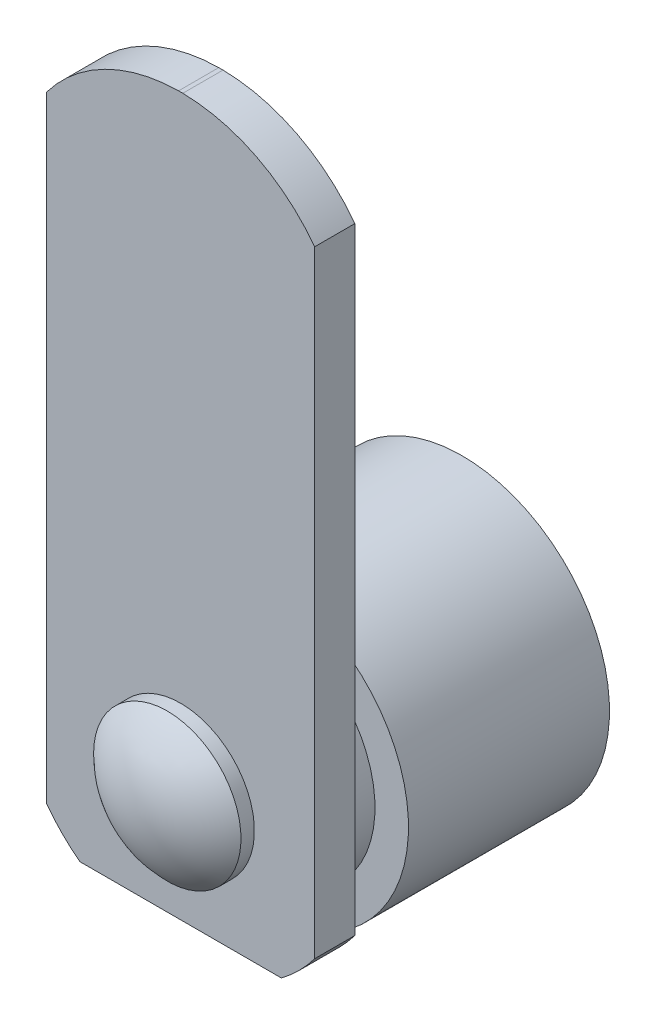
ISO-10303-21;
HEADER;
FILE_DESCRIPTION(('STEP AP214'),'2;1');
FILE_NAME('part.step','',(''),(''),'','','');
FILE_SCHEMA(('AUTOMOTIVE_DESIGN { 1 0 10303 214 1 1 1 1 }'));
ENDSEC;
DATA;
#1=APPLICATION_CONTEXT('core data for automotive mechanical design processes');
#2=APPLICATION_PROTOCOL_DEFINITION('international standard','automotive_design',2000,#1);
#3=PRODUCT_CONTEXT('',#1,'mechanical');
#4=PRODUCT('Part','Part','',(#3));
#5=PRODUCT_RELATED_PRODUCT_CATEGORY('part','',(#4));
#6=PRODUCT_DEFINITION_FORMATION('','',#4);
#7=PRODUCT_DEFINITION_CONTEXT('part definition',#1,'design');
#8=PRODUCT_DEFINITION('design','',#6,#7);
#9=PRODUCT_DEFINITION_SHAPE('','',#8);
#10=(LENGTH_UNIT() NAMED_UNIT(*) SI_UNIT(.MILLI.,.METRE.));
#11=(NAMED_UNIT(*) PLANE_ANGLE_UNIT() SI_UNIT($,.RADIAN.));
#12=(NAMED_UNIT(*) SI_UNIT($,.STERADIAN.) SOLID_ANGLE_UNIT());
#13=UNCERTAINTY_MEASURE_WITH_UNIT(LENGTH_MEASURE(1.E-05),#10,'distance_accuracy_value','');
#14=(GEOMETRIC_REPRESENTATION_CONTEXT(3) GLOBAL_UNCERTAINTY_ASSIGNED_CONTEXT((#13)) GLOBAL_UNIT_ASSIGNED_CONTEXT((#10,
#11,#12)) REPRESENTATION_CONTEXT('',''));
#15=CARTESIAN_POINT('',(0.,0.,0.));
#16=DIRECTION('',(0.,0.,1.));
#17=DIRECTION('',(1.,0.,0.));
#18=AXIS2_PLACEMENT_3D('',#15,#16,#17);
#19=CARTESIAN_POINT('',(0.,0.,-6.));
#20=DIRECTION('',(0.,0.,-1.));
#21=DIRECTION('',(-1.,0.,0.));
#22=AXIS2_PLACEMENT_3D('',#19,#20,#21);
#23=CYLINDRICAL_SURFACE('',#22,11.);
#24=CARTESIAN_POINT('',(0.,0.,15.));
#25=DIRECTION('',(0.,0.,-1.));
#26=DIRECTION('',(-1.,0.,0.));
#27=AXIS2_PLACEMENT_3D('',#24,#25,#26);
#28=CIRCLE('',#27,11.);
#29=CARTESIAN_POINT('',(-11.,0.,15.));
#30=VERTEX_POINT('',#29);
#31=EDGE_CURVE('E127',#30,#30,#28,.T.);
#32=ORIENTED_EDGE('',*,*,#31,.T.);
#33=EDGE_LOOP('',(#32));
#34=FACE_BOUND('',#33,.T.);
#35=CARTESIAN_POINT('',(0.,0.,0.));
#36=DIRECTION('',(0.,0.,-1.));
#37=DIRECTION('',(-1.,0.,0.));
#38=AXIS2_PLACEMENT_3D('',#35,#36,#37);
#39=CIRCLE('',#38,11.);
#40=CARTESIAN_POINT('',(-11.,0.,0.));
#41=VERTEX_POINT('',#40);
#42=EDGE_CURVE('E218',#41,#41,#39,.T.);
#43=ORIENTED_EDGE('',*,*,#42,.F.);
#44=EDGE_LOOP('',(#43));
#45=FACE_BOUND('',#44,.T.);
#46=ADVANCED_FACE('F14',(#34,#45),#23,.T.);
#47=CARTESIAN_POINT('',(0.,0.,18.));
#48=DIRECTION('',(0.,0.,-1.));
#49=DIRECTION('',(-1.,0.,0.));
#50=AXIS2_PLACEMENT_3D('',#47,#48,#49);
#51=CONICAL_SURFACE('',#50,7.79,0.785398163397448);
#52=CARTESIAN_POINT('',(0.,0.,17.29));
#53=DIRECTION('',(0.,0.,-1.));
#54=DIRECTION('',(-1.,0.,0.));
#55=AXIS2_PLACEMENT_3D('',#52,#53,#54);
#56=CIRCLE('',#55,8.5);
#57=CARTESIAN_POINT('',(-8.5,0.,17.29));
#58=VERTEX_POINT('',#57);
#59=EDGE_CURVE('E133',#58,#58,#56,.T.);
#60=ORIENTED_EDGE('',*,*,#59,.F.);
#61=EDGE_LOOP('',(#60));
#62=FACE_BOUND('',#61,.T.);
#63=CARTESIAN_POINT('',(0.,0.,18.));
#64=DIRECTION('',(0.,0.,1.));
#65=DIRECTION('',(1.,0.,0.));
#66=AXIS2_PLACEMENT_3D('',#63,#64,#65);
#67=CIRCLE('',#66,7.79);
#68=CARTESIAN_POINT('',(7.79,0.,18.));
#69=VERTEX_POINT('',#68);
#70=EDGE_CURVE('E124',#69,#69,#67,.T.);
#71=ORIENTED_EDGE('',*,*,#70,.F.);
#72=EDGE_LOOP('',(#71));
#73=FACE_BOUND('',#72,.T.);
#74=ADVANCED_FACE('F157',(#62,#73),#51,.T.);
#75=CARTESIAN_POINT('',(0.,0.,-6.));
#76=DIRECTION('',(0.,0.,-1.));
#77=DIRECTION('',(-1.,0.,0.));
#78=AXIS2_PLACEMENT_3D('',#75,#76,#77);
#79=CYLINDRICAL_SURFACE('',#78,8.5);
#80=CARTESIAN_POINT('',(0.,0.,15.));
#81=DIRECTION('',(0.,0.,-1.));
#82=DIRECTION('',(-1.,0.,0.));
#83=AXIS2_PLACEMENT_3D('',#80,#81,#82);
#84=CIRCLE('',#83,8.5);
#85=CARTESIAN_POINT('',(-8.5,0.,15.));
#86=VERTEX_POINT('',#85);
#87=EDGE_CURVE('E130',#86,#86,#84,.T.);
#88=ORIENTED_EDGE('',*,*,#87,.F.);
#89=EDGE_LOOP('',(#88));
#90=FACE_BOUND('',#89,.T.);
#91=ORIENTED_EDGE('',*,*,#59,.T.);
#92=EDGE_LOOP('',(#91));
#93=FACE_BOUND('',#92,.T.);
#94=ADVANCED_FACE('F164',(#90,#93),#79,.T.);
#95=CARTESIAN_POINT('',(0.,8.5,15.));
#96=DIRECTION('',(0.,0.,-1.));
#97=DIRECTION('',(-1.,0.,0.));
#98=AXIS2_PLACEMENT_3D('',#95,#96,#97);
#99=PLANE('',#98);
#100=ORIENTED_EDGE('',*,*,#31,.F.);
#101=EDGE_LOOP('',(#100));
#102=FACE_BOUND('',#101,.T.);
#103=ORIENTED_EDGE('',*,*,#87,.T.);
#104=EDGE_LOOP('',(#103));
#105=FACE_BOUND('',#104,.T.);
#106=ADVANCED_FACE('F172',(#102,#105),#99,.F.);
#107=CARTESIAN_POINT('',(10.,45.,18.));
#108=DIRECTION('',(0.,-1.,0.));
#109=DIRECTION('',(-1.,0.,0.));
#110=AXIS2_PLACEMENT_3D('',#107,#108,#109);
#111=PLANE('',#110);
#112=DIRECTION('',(-1.,0.,0.));
#113=VECTOR('',#112,1.);
#114=CARTESIAN_POINT('',(10.,45.,21.));
#115=LINE('',#114,#113);
#116=CARTESIAN_POINT('',(0.158110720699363,45.,21.));
#117=VERTEX_POINT('',#116);
#118=CARTESIAN_POINT('',(-0.158110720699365,45.,21.));
#119=VERTEX_POINT('',#118);
#120=EDGE_CURVE('E96',#117,#119,#115,.T.);
#121=ORIENTED_EDGE('',*,*,#120,.F.);
#122=DIRECTION('',(0.,0.,1.));
#123=VECTOR('',#122,1.);
#124=CARTESIAN_POINT('',(0.158110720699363,45.,16.));
#125=LINE('',#124,#123);
#126=CARTESIAN_POINT('',(0.158110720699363,45.,18.));
#127=VERTEX_POINT('',#126);
#128=EDGE_CURVE('E210',#117,#127,#125,.F.);
#129=ORIENTED_EDGE('',*,*,#128,.T.);
#130=DIRECTION('',(-1.,0.,0.));
#131=VECTOR('',#130,1.);
#132=CARTESIAN_POINT('',(10.,45.,18.));
#133=LINE('',#132,#131);
#134=CARTESIAN_POINT('',(-0.158110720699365,45.,18.));
#135=VERTEX_POINT('',#134);
#136=EDGE_CURVE('E114',#127,#135,#133,.T.);
#137=ORIENTED_EDGE('',*,*,#136,.T.);
#138=DIRECTION('',(0.,0.,1.));
#139=VECTOR('',#138,1.);
#140=CARTESIAN_POINT('',(-0.158110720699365,45.,16.));
#141=LINE('',#140,#139);
#142=EDGE_CURVE('E98',#135,#119,#141,.T.);
#143=ORIENTED_EDGE('',*,*,#142,.T.);
#144=EDGE_LOOP('',(#121,#129,#137,#143));
#145=FACE_BOUND('',#144,.T.);
#146=ADVANCED_FACE('F170',(#145),#111,.F.);
#147=CARTESIAN_POINT('',(10.,45.,21.));
#148=DIRECTION('',(0.,0.,-1.));
#149=DIRECTION('',(-1.,0.,0.));
#150=AXIS2_PLACEMENT_3D('',#147,#148,#149);
#151=PLANE('',#150);
#152=CARTESIAN_POINT('',(0.,0.,21.));
#153=DIRECTION('',(0.,0.,-1.));
#154=DIRECTION('',(-1.,0.,0.));
#155=AXIS2_PLACEMENT_3D('',#152,#153,#154);
#156=CIRCLE('',#155,5.5);
#157=CARTESIAN_POINT('',(-5.5,0.,21.));
#158=VERTEX_POINT('',#157);
#159=EDGE_CURVE('E88',#158,#158,#156,.T.);
#160=ORIENTED_EDGE('',*,*,#159,.T.);
#161=EDGE_LOOP('',(#160));
#162=FACE_BOUND('',#161,.T.);
#163=DIRECTION('',(0.,-1.,0.));
#164=VECTOR('',#163,1.);
#165=CARTESIAN_POINT('',(-10.,45.,21.));
#166=LINE('',#165,#164);
#167=CARTESIAN_POINT('',(-10.,40.001,21.));
#168=VERTEX_POINT('',#167);
#169=CARTESIAN_POINT('',(-10.,-6.01,21.));
#170=VERTEX_POINT('',#169);
#171=EDGE_CURVE('E94',#168,#170,#166,.T.);
#172=ORIENTED_EDGE('',*,*,#171,.T.);
#173=CARTESIAN_POINT('',(0.,1.49,21.));
#174=DIRECTION('',(0.,0.,-1.));
#175=DIRECTION('',(-1.,0.,0.));
#176=AXIS2_PLACEMENT_3D('',#173,#174,#175);
#177=CIRCLE('',#176,12.5);
#178=CARTESIAN_POINT('',(-7.51331484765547,-8.5,21.));
#179=VERTEX_POINT('',#178);
#180=EDGE_CURVE('E109',#170,#179,#177,.F.);
#181=ORIENTED_EDGE('',*,*,#180,.T.);
#182=DIRECTION('',(-1.,0.,0.));
#183=VECTOR('',#182,1.);
#184=CARTESIAN_POINT('',(10.,-8.5,21.));
#185=LINE('',#184,#183);
#186=CARTESIAN_POINT('',(7.51331484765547,-8.5,21.));
#187=VERTEX_POINT('',#186);
#188=EDGE_CURVE('E120',#187,#179,#185,.T.);
#189=ORIENTED_EDGE('',*,*,#188,.F.);
#190=CARTESIAN_POINT('',(10.,-6.01,21.));
#191=VERTEX_POINT('',#190);
#192=EDGE_CURVE('E102',#187,#191,#177,.F.);
#193=ORIENTED_EDGE('',*,*,#192,.T.);
#194=DIRECTION('',(0.,-1.,0.));
#195=VECTOR('',#194,1.);
#196=CARTESIAN_POINT('',(10.,45.,21.));
#197=LINE('',#196,#195);
#198=CARTESIAN_POINT('',(10.,40.001,21.));
#199=VERTEX_POINT('',#198);
#200=EDGE_CURVE('E104',#199,#191,#197,.T.);
#201=ORIENTED_EDGE('',*,*,#200,.F.);
#202=CARTESIAN_POINT('',(0.,32.501,21.));
#203=DIRECTION('',(0.,0.,-1.));
#204=DIRECTION('',(-1.,0.,0.));
#205=AXIS2_PLACEMENT_3D('',#202,#203,#204);
#206=CIRCLE('',#205,12.5);
#207=EDGE_CURVE('E37',#199,#117,#206,.F.);
#208=ORIENTED_EDGE('',*,*,#207,.T.);
#209=ORIENTED_EDGE('',*,*,#120,.T.);
#210=EDGE_CURVE('E80',#119,#168,#206,.F.);
#211=ORIENTED_EDGE('',*,*,#210,.T.);
#212=EDGE_LOOP('',(#172,#181,#189,#193,#201,#208,#209,#211));
#213=FACE_BOUND('',#212,.T.);
#214=ADVANCED_FACE('F92',(#162,#213),#151,.F.);
#215=CARTESIAN_POINT('',(10.,-8.5,21.));
#216=DIRECTION('',(0.,1.,0.));
#217=DIRECTION('',(1.,0.,0.));
#218=AXIS2_PLACEMENT_3D('',#215,#216,#217);
#219=PLANE('',#218);
#220=ORIENTED_EDGE('',*,*,#188,.T.);
#221=DIRECTION('',(0.,0.,1.));
#222=VECTOR('',#221,1.);
#223=CARTESIAN_POINT('',(-7.51331484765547,-8.5,16.));
#224=LINE('',#223,#222);
#225=CARTESIAN_POINT('',(-7.51331484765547,-8.5,18.));
#226=VERTEX_POINT('',#225);
#227=EDGE_CURVE('E204',#179,#226,#224,.F.);
#228=ORIENTED_EDGE('',*,*,#227,.T.);
#229=DIRECTION('',(-1.,0.,0.));
#230=VECTOR('',#229,1.);
#231=CARTESIAN_POINT('',(10.,-8.5,18.));
#232=LINE('',#231,#230);
#233=CARTESIAN_POINT('',(7.51331484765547,-8.5,18.));
#234=VERTEX_POINT('',#233);
#235=EDGE_CURVE('E117',#234,#226,#232,.T.);
#236=ORIENTED_EDGE('',*,*,#235,.F.);
#237=DIRECTION('',(0.,0.,1.));
#238=VECTOR('',#237,1.);
#239=CARTESIAN_POINT('',(7.51331484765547,-8.5,16.));
#240=LINE('',#239,#238);
#241=EDGE_CURVE('E107',#234,#187,#240,.T.);
#242=ORIENTED_EDGE('',*,*,#241,.T.);
#243=EDGE_LOOP('',(#220,#228,#236,#242));
#244=FACE_BOUND('',#243,.T.);
#245=ADVANCED_FACE('F190',(#244),#219,.F.);
#246=CARTESIAN_POINT('',(10.,-8.5,18.));
#247=DIRECTION('',(0.,0.,1.));
#248=DIRECTION('',(1.,0.,0.));
#249=AXIS2_PLACEMENT_3D('',#246,#247,#248);
#250=PLANE('',#249);
#251=ORIENTED_EDGE('',*,*,#70,.T.);
#252=EDGE_LOOP('',(#251));
#253=FACE_BOUND('',#252,.T.);
#254=DIRECTION('',(0.,1.,0.));
#255=VECTOR('',#254,1.);
#256=CARTESIAN_POINT('',(10.,-8.5,18.));
#257=LINE('',#256,#255);
#258=CARTESIAN_POINT('',(10.,-6.01,18.));
#259=VERTEX_POINT('',#258);
#260=CARTESIAN_POINT('',(10.,40.001,18.));
#261=VERTEX_POINT('',#260);
#262=EDGE_CURVE('E111',#259,#261,#257,.T.);
#263=ORIENTED_EDGE('',*,*,#262,.F.);
#264=CARTESIAN_POINT('',(0.,1.49,18.));
#265=DIRECTION('',(0.,0.,1.));
#266=DIRECTION('',(1.,0.,0.));
#267=AXIS2_PLACEMENT_3D('',#264,#265,#266);
#268=CIRCLE('',#267,12.5);
#269=EDGE_CURVE('E29',#259,#234,#268,.F.);
#270=ORIENTED_EDGE('',*,*,#269,.T.);
#271=ORIENTED_EDGE('',*,*,#235,.T.);
#272=CARTESIAN_POINT('',(-10.,-6.01,18.));
#273=VERTEX_POINT('',#272);
#274=EDGE_CURVE('E97',#226,#273,#268,.F.);
#275=ORIENTED_EDGE('',*,*,#274,.T.);
#276=DIRECTION('',(0.,1.,0.));
#277=VECTOR('',#276,1.);
#278=CARTESIAN_POINT('',(-10.,-8.5,18.));
#279=LINE('',#278,#277);
#280=CARTESIAN_POINT('',(-10.,40.001,18.));
#281=VERTEX_POINT('',#280);
#282=EDGE_CURVE('E101',#273,#281,#279,.T.);
#283=ORIENTED_EDGE('',*,*,#282,.T.);
#284=CARTESIAN_POINT('',(0.,32.501,18.));
#285=DIRECTION('',(0.,0.,1.));
#286=DIRECTION('',(1.,0.,0.));
#287=AXIS2_PLACEMENT_3D('',#284,#285,#286);
#288=CIRCLE('',#287,12.5);
#289=EDGE_CURVE('E83',#281,#135,#288,.F.);
#290=ORIENTED_EDGE('',*,*,#289,.T.);
#291=ORIENTED_EDGE('',*,*,#136,.F.);
#292=EDGE_CURVE('E197',#127,#261,#288,.F.);
#293=ORIENTED_EDGE('',*,*,#292,.T.);
#294=EDGE_LOOP('',(#263,#270,#271,#275,#283,#290,#291,#293));
#295=FACE_BOUND('',#294,.T.);
#296=ADVANCED_FACE('F187',(#253,#295),#250,.F.);
#297=CARTESIAN_POINT('',(10.,0.,-2.));
#298=DIRECTION('',(1.,0.,0.));
#299=DIRECTION('',(0.,0.,-1.));
#300=AXIS2_PLACEMENT_3D('',#297,#298,#299);
#301=PLANE('',#300);
#302=DIRECTION('',(0.,0.,1.));
#303=VECTOR('',#302,1.);
#304=CARTESIAN_POINT('',(10.,-6.01,16.));
#305=LINE('',#304,#303);
#306=EDGE_CURVE('E214',#259,#191,#305,.T.);
#307=ORIENTED_EDGE('',*,*,#306,.F.);
#308=ORIENTED_EDGE('',*,*,#262,.T.);
#309=DIRECTION('',(0.,0.,1.));
#310=VECTOR('',#309,1.);
#311=CARTESIAN_POINT('',(10.,40.001,16.));
#312=LINE('',#311,#310);
#313=EDGE_CURVE('E216',#261,#199,#312,.T.);
#314=ORIENTED_EDGE('',*,*,#313,.T.);
#315=ORIENTED_EDGE('',*,*,#200,.T.);
#316=EDGE_LOOP('',(#307,#308,#314,#315));
#317=FACE_BOUND('',#316,.T.);
#318=ADVANCED_FACE('F154',(#317),#301,.T.);
#319=CARTESIAN_POINT('',(-10.,0.,-2.));
#320=DIRECTION('',(1.,0.,0.));
#321=DIRECTION('',(0.,0.,-1.));
#322=AXIS2_PLACEMENT_3D('',#319,#320,#321);
#323=PLANE('',#322);
#324=ORIENTED_EDGE('',*,*,#282,.F.);
#325=DIRECTION('',(0.,0.,1.));
#326=VECTOR('',#325,1.);
#327=CARTESIAN_POINT('',(-10.,-6.01,16.));
#328=LINE('',#327,#326);
#329=EDGE_CURVE('E9',#273,#170,#328,.T.);
#330=ORIENTED_EDGE('',*,*,#329,.T.);
#331=ORIENTED_EDGE('',*,*,#171,.F.);
#332=DIRECTION('',(0.,0.,1.));
#333=VECTOR('',#332,1.);
#334=CARTESIAN_POINT('',(-10.,40.001,16.));
#335=LINE('',#334,#333);
#336=EDGE_CURVE('E22',#168,#281,#335,.F.);
#337=ORIENTED_EDGE('',*,*,#336,.T.);
#338=EDGE_LOOP('',(#324,#330,#331,#337));
#339=FACE_BOUND('',#338,.T.);
#340=ADVANCED_FACE('F100',(#339),#323,.F.);
#341=CARTESIAN_POINT('',(0.,0.,16.5739130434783));
#342=DIRECTION('',(0.,0.,-1.));
#343=DIRECTION('',(0.,1.,0.));
#344=AXIS2_PLACEMENT_3D('',#341,#342,#343);
#345=SPHERICAL_SURFACE('',#344,7.72608695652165);
#346=CARTESIAN_POINT('',(0.,0.,22.));
#347=DIRECTION('',(0.,0.,-1.));
#348=DIRECTION('',(-1.,0.,0.));
#349=AXIS2_PLACEMENT_3D('',#346,#347,#348);
#350=CIRCLE('',#349,5.5);
#351=CARTESIAN_POINT('',(-5.5,0.,22.));
#352=VERTEX_POINT('',#351);
#353=EDGE_CURVE('E136',#352,#352,#350,.T.);
#354=ORIENTED_EDGE('',*,*,#353,.F.);
#355=EDGE_LOOP('',(#354));
#356=FACE_BOUND('',#355,.T.);
#357=ADVANCED_FACE('F16',(#356),#345,.T.);
#358=CARTESIAN_POINT('',(0.,0.,-6.));
#359=DIRECTION('',(0.,0.,-1.));
#360=DIRECTION('',(-1.,0.,0.));
#361=AXIS2_PLACEMENT_3D('',#358,#359,#360);
#362=CYLINDRICAL_SURFACE('',#361,5.5);
#363=ORIENTED_EDGE('',*,*,#159,.F.);
#364=EDGE_LOOP('',(#363));
#365=FACE_BOUND('',#364,.T.);
#366=ORIENTED_EDGE('',*,*,#353,.T.);
#367=EDGE_LOOP('',(#366));
#368=FACE_BOUND('',#367,.T.);
#369=ADVANCED_FACE('F143',(#365,#368),#362,.T.);
#370=CARTESIAN_POINT('',(0.,32.501,16.));
#371=DIRECTION('',(0.,0.,1.));
#372=DIRECTION('',(1.,0.,0.));
#373=AXIS2_PLACEMENT_3D('',#370,#371,#372);
#374=CYLINDRICAL_SURFACE('',#373,12.5);
#375=ORIENTED_EDGE('',*,*,#142,.F.);
#376=ORIENTED_EDGE('',*,*,#289,.F.);
#377=ORIENTED_EDGE('',*,*,#336,.F.);
#378=ORIENTED_EDGE('',*,*,#210,.F.);
#379=EDGE_LOOP('',(#375,#376,#377,#378));
#380=FACE_BOUND('',#379,.T.);
#381=ADVANCED_FACE('F79',(#380),#374,.T.);
#382=CARTESIAN_POINT('',(0.,1.49,16.));
#383=DIRECTION('',(0.,0.,1.));
#384=DIRECTION('',(1.,0.,0.));
#385=AXIS2_PLACEMENT_3D('',#382,#383,#384);
#386=CYLINDRICAL_SURFACE('',#385,12.5);
#387=ORIENTED_EDGE('',*,*,#329,.F.);
#388=ORIENTED_EDGE('',*,*,#274,.F.);
#389=ORIENTED_EDGE('',*,*,#227,.F.);
#390=ORIENTED_EDGE('',*,*,#180,.F.);
#391=EDGE_LOOP('',(#387,#388,#389,#390));
#392=FACE_BOUND('',#391,.T.);
#393=ADVANCED_FACE('F249',(#392),#386,.T.);
#394=ORIENTED_EDGE('',*,*,#313,.F.);
#395=ORIENTED_EDGE('',*,*,#292,.F.);
#396=ORIENTED_EDGE('',*,*,#128,.F.);
#397=ORIENTED_EDGE('',*,*,#207,.F.);
#398=EDGE_LOOP('',(#394,#395,#396,#397));
#399=FACE_BOUND('',#398,.T.);
#400=ADVANCED_FACE('F250',(#399),#374,.T.);
#401=ORIENTED_EDGE('',*,*,#241,.F.);
#402=ORIENTED_EDGE('',*,*,#269,.F.);
#403=ORIENTED_EDGE('',*,*,#306,.T.);
#404=ORIENTED_EDGE('',*,*,#192,.F.);
#405=EDGE_LOOP('',(#401,#402,#403,#404));
#406=FACE_BOUND('',#405,.T.);
#407=ADVANCED_FACE('F245',(#406),#386,.T.);
#408=CARTESIAN_POINT('',(0.,0.,-2.));
#409=DIRECTION('',(0.,0.,-1.));
#410=DIRECTION('',(-1.,0.,0.));
#411=AXIS2_PLACEMENT_3D('',#408,#409,#410);
#412=PLANE('',#411);
#413=CARTESIAN_POINT('',(0.,0.,-2.));
#414=DIRECTION('',(0.,0.,-1.));
#415=DIRECTION('',(-1.,0.,0.));
#416=AXIS2_PLACEMENT_3D('',#413,#414,#415);
#417=CIRCLE('',#416,8.);
#418=CARTESIAN_POINT('',(-8.,0.,-2.));
#419=VERTEX_POINT('',#418);
#420=EDGE_CURVE('E222',#419,#419,#417,.T.);
#421=ORIENTED_EDGE('',*,*,#420,.T.);
#422=EDGE_LOOP('',(#421));
#423=FACE_BOUND('',#422,.T.);
#424=ADVANCED_FACE('F240',(#423),#412,.T.);
#425=CARTESIAN_POINT('',(0.,0.,0.));
#426=DIRECTION('',(0.,0.,-1.));
#427=DIRECTION('',(-1.,0.,0.));
#428=AXIS2_PLACEMENT_3D('',#425,#426,#427);
#429=CYLINDRICAL_SURFACE('',#428,8.);
#430=CARTESIAN_POINT('',(0.,0.,0.));
#431=DIRECTION('',(0.,0.,-1.));
#432=DIRECTION('',(-1.,0.,0.));
#433=AXIS2_PLACEMENT_3D('',#430,#431,#432);
#434=CIRCLE('',#433,8.);
#435=CARTESIAN_POINT('',(-8.,0.,0.));
#436=VERTEX_POINT('',#435);
#437=EDGE_CURVE('E221',#436,#436,#434,.T.);
#438=ORIENTED_EDGE('',*,*,#437,.T.);
#439=EDGE_LOOP('',(#438));
#440=FACE_BOUND('',#439,.T.);
#441=ORIENTED_EDGE('',*,*,#420,.F.);
#442=EDGE_LOOP('',(#441));
#443=FACE_BOUND('',#442,.T.);
#444=ADVANCED_FACE('F228',(#440,#443),#429,.T.);
#445=CARTESIAN_POINT('',(0.,0.,0.));
#446=DIRECTION('',(0.,0.,-1.));
#447=DIRECTION('',(-1.,0.,0.));
#448=AXIS2_PLACEMENT_3D('',#445,#446,#447);
#449=PLANE('',#448);
#450=ORIENTED_EDGE('',*,*,#437,.F.);
#451=EDGE_LOOP('',(#450));
#452=FACE_BOUND('',#451,.T.);
#453=ORIENTED_EDGE('',*,*,#42,.T.);
#454=EDGE_LOOP('',(#453));
#455=FACE_BOUND('',#454,.T.);
#456=ADVANCED_FACE('F231',(#452,#455),#449,.T.);
#457=CLOSED_SHELL('',(#46,#74,#94,#106,#146,#214,#245,#296,#318,#340,#357,#369,#381,#393,#400,
#407,#424,#444,#456));
#458=MANIFOLD_SOLID_BREP('B1',#457);
#459=ADVANCED_BREP_SHAPE_REPRESENTATION('',(#18,#458),#14);
#460=SHAPE_DEFINITION_REPRESENTATION(#9,#459);
ENDSEC;
END-ISO-10303-21;
